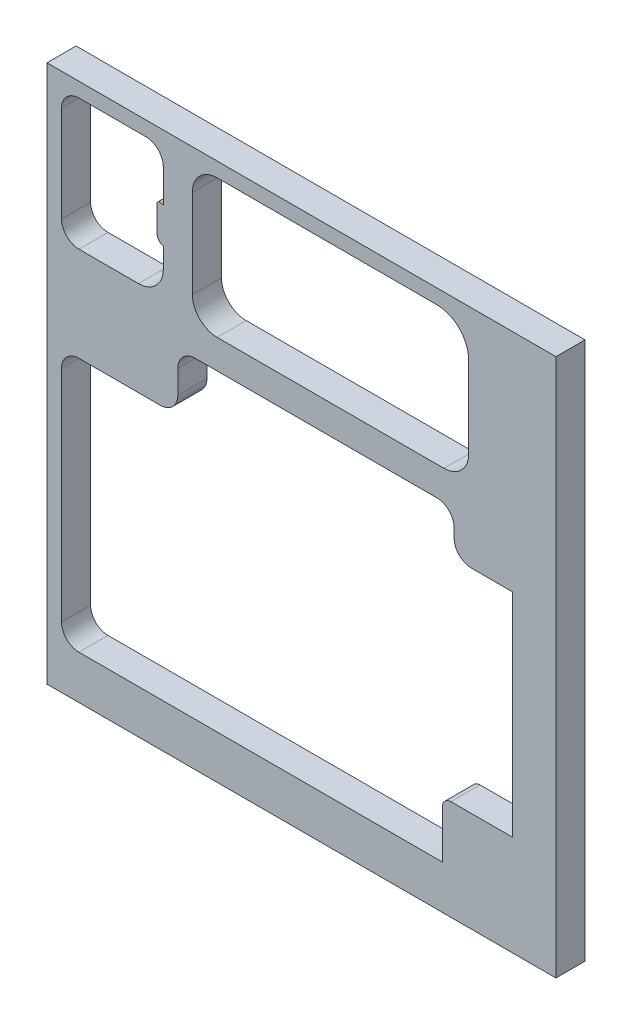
ISO-10303-21;
HEADER;
FILE_DESCRIPTION(('STEP AP214'),'2;1');
FILE_NAME('part.step','',(''),(''),'','','');
FILE_SCHEMA(('AUTOMOTIVE_DESIGN { 1 0 10303 214 1 1 1 1 }'));
ENDSEC;
DATA;
#1=APPLICATION_CONTEXT('core data for automotive mechanical design processes');
#2=APPLICATION_PROTOCOL_DEFINITION('international standard','automotive_design',2000,#1);
#3=PRODUCT_CONTEXT('',#1,'mechanical');
#4=PRODUCT('Part','Part','',(#3));
#5=PRODUCT_RELATED_PRODUCT_CATEGORY('part','',(#4));
#6=PRODUCT_DEFINITION_FORMATION('','',#4);
#7=PRODUCT_DEFINITION_CONTEXT('part definition',#1,'design');
#8=PRODUCT_DEFINITION('design','',#6,#7);
#9=PRODUCT_DEFINITION_SHAPE('','',#8);
#10=(LENGTH_UNIT() NAMED_UNIT(*) SI_UNIT(.MILLI.,.METRE.));
#11=(NAMED_UNIT(*) PLANE_ANGLE_UNIT() SI_UNIT($,.RADIAN.));
#12=(NAMED_UNIT(*) SI_UNIT($,.STERADIAN.) SOLID_ANGLE_UNIT());
#13=UNCERTAINTY_MEASURE_WITH_UNIT(LENGTH_MEASURE(1.E-05),#10,'distance_accuracy_value','');
#14=(GEOMETRIC_REPRESENTATION_CONTEXT(3) GLOBAL_UNCERTAINTY_ASSIGNED_CONTEXT((#13)) GLOBAL_UNIT_ASSIGNED_CONTEXT((#10,
#11,#12)) REPRESENTATION_CONTEXT('',''));
#15=CARTESIAN_POINT('',(0.,0.,0.));
#16=DIRECTION('',(0.,0.,1.));
#17=DIRECTION('',(1.,0.,0.));
#18=AXIS2_PLACEMENT_3D('',#15,#16,#17);
#19=CARTESIAN_POINT('',(19.05,215.9,-336.11392208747));
#20=DIRECTION('',(0.,1.,0.));
#21=DIRECTION('',(-1.,0.,0.));
#22=AXIS2_PLACEMENT_3D('',#19,#20,#21);
#23=PLANE('',#22);
#24=DIRECTION('',(1.,0.,0.));
#25=VECTOR('',#24,1.);
#26=CARTESIAN_POINT('',(19.05,215.9,-12.7));
#27=LINE('',#26,#25);
#28=CARTESIAN_POINT('',(-203.2,215.9,-12.7));
#29=VERTEX_POINT('',#28);
#30=CARTESIAN_POINT('',(19.05,215.9,-12.7));
#31=VERTEX_POINT('',#30);
#32=EDGE_CURVE('E11',#29,#31,#27,.T.);
#33=ORIENTED_EDGE('',*,*,#32,.F.);
#34=DIRECTION('',(0.,0.,1.));
#35=VECTOR('',#34,1.);
#36=CARTESIAN_POINT('',(-203.2,215.9,-336.11392208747));
#37=LINE('',#36,#35);
#38=CARTESIAN_POINT('',(-203.2,215.9,0.));
#39=VERTEX_POINT('',#38);
#40=EDGE_CURVE('E362',#29,#39,#37,.T.);
#41=ORIENTED_EDGE('',*,*,#40,.T.);
#42=DIRECTION('',(-1.,0.,0.));
#43=VECTOR('',#42,1.);
#44=CARTESIAN_POINT('',(19.05,215.9,0.));
#45=LINE('',#44,#43);
#46=CARTESIAN_POINT('',(19.05,215.9,0.));
#47=VERTEX_POINT('',#46);
#48=EDGE_CURVE('E347',#47,#39,#45,.T.);
#49=ORIENTED_EDGE('',*,*,#48,.F.);
#50=DIRECTION('',(0.,0.,1.));
#51=VECTOR('',#50,1.);
#52=CARTESIAN_POINT('',(19.05,215.9,-336.11392208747));
#53=LINE('',#52,#51);
#54=EDGE_CURVE('E356',#31,#47,#53,.T.);
#55=ORIENTED_EDGE('',*,*,#54,.F.);
#56=EDGE_LOOP('',(#33,#41,#49,#55));
#57=FACE_BOUND('',#56,.T.);
#58=ADVANCED_FACE('F41',(#57),#23,.T.);
#59=CARTESIAN_POINT('',(-203.2,-19.05,-336.11392208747));
#60=DIRECTION('',(-1.,0.,0.));
#61=DIRECTION('',(0.,0.,1.));
#62=AXIS2_PLACEMENT_3D('',#59,#60,#61);
#63=PLANE('',#62);
#64=DIRECTION('',(0.,1.,0.));
#65=VECTOR('',#64,1.);
#66=CARTESIAN_POINT('',(-203.2,-19.05,-12.7));
#67=LINE('',#66,#65);
#68=CARTESIAN_POINT('',(-203.2,-19.05,-12.7));
#69=VERTEX_POINT('',#68);
#70=EDGE_CURVE('E459',#69,#29,#67,.T.);
#71=ORIENTED_EDGE('',*,*,#70,.F.);
#72=DIRECTION('',(0.,0.,1.));
#73=VECTOR('',#72,1.);
#74=CARTESIAN_POINT('',(-203.2,-19.05,-336.11392208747));
#75=LINE('',#74,#73);
#76=CARTESIAN_POINT('',(-203.2,-19.05,0.));
#77=VERTEX_POINT('',#76);
#78=EDGE_CURVE('E359',#69,#77,#75,.T.);
#79=ORIENTED_EDGE('',*,*,#78,.T.);
#80=DIRECTION('',(0.,-1.,0.));
#81=VECTOR('',#80,1.);
#82=CARTESIAN_POINT('',(-203.2,-19.05,0.));
#83=LINE('',#82,#81);
#84=EDGE_CURVE('E350',#39,#77,#83,.T.);
#85=ORIENTED_EDGE('',*,*,#84,.F.);
#86=ORIENTED_EDGE('',*,*,#40,.F.);
#87=EDGE_LOOP('',(#71,#79,#85,#86));
#88=FACE_BOUND('',#87,.T.);
#89=ADVANCED_FACE('F658',(#88),#63,.T.);
#90=CARTESIAN_POINT('',(19.05,-19.05,-336.11392208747));
#91=DIRECTION('',(0.,-1.,0.));
#92=DIRECTION('',(1.,0.,0.));
#93=AXIS2_PLACEMENT_3D('',#90,#91,#92);
#94=PLANE('',#93);
#95=DIRECTION('',(-1.,0.,0.));
#96=VECTOR('',#95,1.);
#97=CARTESIAN_POINT('',(19.05,-19.05,-12.7));
#98=LINE('',#97,#96);
#99=CARTESIAN_POINT('',(19.05,-19.05,-12.7));
#100=VERTEX_POINT('',#99);
#101=EDGE_CURVE('E461',#100,#69,#98,.T.);
#102=ORIENTED_EDGE('',*,*,#101,.F.);
#103=DIRECTION('',(0.,0.,1.));
#104=VECTOR('',#103,1.);
#105=CARTESIAN_POINT('',(19.05,-19.05,-336.11392208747));
#106=LINE('',#105,#104);
#107=CARTESIAN_POINT('',(19.05,-19.05,0.));
#108=VERTEX_POINT('',#107);
#109=EDGE_CURVE('E167',#100,#108,#106,.T.);
#110=ORIENTED_EDGE('',*,*,#109,.T.);
#111=DIRECTION('',(1.,0.,0.));
#112=VECTOR('',#111,1.);
#113=CARTESIAN_POINT('',(19.05,-19.05,0.));
#114=LINE('',#113,#112);
#115=EDGE_CURVE('E353',#77,#108,#114,.T.);
#116=ORIENTED_EDGE('',*,*,#115,.F.);
#117=ORIENTED_EDGE('',*,*,#78,.F.);
#118=EDGE_LOOP('',(#102,#110,#116,#117));
#119=FACE_BOUND('',#118,.T.);
#120=ADVANCED_FACE('F392',(#119),#94,.T.);
#121=CARTESIAN_POINT('',(19.05,-19.05,-336.11392208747));
#122=DIRECTION('',(1.,0.,0.));
#123=DIRECTION('',(0.,0.,-1.));
#124=AXIS2_PLACEMENT_3D('',#121,#122,#123);
#125=PLANE('',#124);
#126=DIRECTION('',(0.,-1.,0.));
#127=VECTOR('',#126,1.);
#128=CARTESIAN_POINT('',(19.05,-19.05,-12.7));
#129=LINE('',#128,#127);
#130=EDGE_CURVE('E375',#31,#100,#129,.T.);
#131=ORIENTED_EDGE('',*,*,#130,.F.);
#132=ORIENTED_EDGE('',*,*,#54,.T.);
#133=DIRECTION('',(0.,1.,0.));
#134=VECTOR('',#133,1.);
#135=CARTESIAN_POINT('',(19.05,-19.05,0.));
#136=LINE('',#135,#134);
#137=EDGE_CURVE('E324',#108,#47,#136,.T.);
#138=ORIENTED_EDGE('',*,*,#137,.F.);
#139=ORIENTED_EDGE('',*,*,#109,.F.);
#140=EDGE_LOOP('',(#131,#132,#138,#139));
#141=FACE_BOUND('',#140,.T.);
#142=ADVANCED_FACE('F43',(#141),#125,.T.);
#143=CARTESIAN_POINT('',(-128.905,149.225,-336.11392208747));
#144=DIRECTION('',(0.,-1.,0.));
#145=DIRECTION('',(1.,0.,0.));
#146=AXIS2_PLACEMENT_3D('',#143,#144,#145);
#147=PLANE('',#146);
#148=DIRECTION('',(0.,0.,1.));
#149=VECTOR('',#148,1.);
#150=CARTESIAN_POINT('',(-29.8450000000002,149.225,-336.11392208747));
#151=LINE('',#150,#149);
#152=CARTESIAN_POINT('',(-29.8450000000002,149.225,-12.7));
#153=VERTEX_POINT('',#152);
#154=CARTESIAN_POINT('',(-29.8450000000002,149.225,0.));
#155=VERTEX_POINT('',#154);
#156=EDGE_CURVE('E340',#153,#155,#151,.T.);
#157=ORIENTED_EDGE('',*,*,#156,.F.);
#158=DIRECTION('',(-1.,0.,0.));
#159=VECTOR('',#158,1.);
#160=CARTESIAN_POINT('',(-128.905,149.225,-12.7));
#161=LINE('',#160,#159);
#162=CARTESIAN_POINT('',(-128.905,149.225,-12.7));
#163=VERTEX_POINT('',#162);
#164=EDGE_CURVE('E60',#153,#163,#161,.T.);
#165=ORIENTED_EDGE('',*,*,#164,.T.);
#166=DIRECTION('',(0.,0.,1.));
#167=VECTOR('',#166,1.);
#168=CARTESIAN_POINT('',(-128.905,149.225,-336.11392208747));
#169=LINE('',#168,#167);
#170=CARTESIAN_POINT('',(-128.905,149.225,0.));
#171=VERTEX_POINT('',#170);
#172=EDGE_CURVE('E320',#163,#171,#169,.T.);
#173=ORIENTED_EDGE('',*,*,#172,.T.);
#174=DIRECTION('',(1.,0.,0.));
#175=VECTOR('',#174,1.);
#176=CARTESIAN_POINT('',(-128.905,149.225,0.));
#177=LINE('',#176,#175);
#178=EDGE_CURVE('E299',#171,#155,#177,.T.);
#179=ORIENTED_EDGE('',*,*,#178,.T.);
#180=EDGE_LOOP('',(#157,#165,#173,#179));
#181=FACE_BOUND('',#180,.T.);
#182=ADVANCED_FACE('F635',(#181),#147,.F.);
#183=CARTESIAN_POINT('',(-29.8450000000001,160.02,-336.11392208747));
#184=DIRECTION('',(0.,0.,1.));
#185=DIRECTION('',(1.,0.,0.));
#186=AXIS2_PLACEMENT_3D('',#183,#184,#185);
#187=CYLINDRICAL_SURFACE('',#186,10.795);
#188=DIRECTION('',(0.,0.,1.));
#189=VECTOR('',#188,1.);
#190=CARTESIAN_POINT('',(-19.0500000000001,160.02,-336.11392208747));
#191=LINE('',#190,#189);
#192=CARTESIAN_POINT('',(-19.0500000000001,160.02,-12.7));
#193=VERTEX_POINT('',#192);
#194=CARTESIAN_POINT('',(-19.0500000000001,160.02,0.));
#195=VERTEX_POINT('',#194);
#196=EDGE_CURVE('E337',#193,#195,#191,.T.);
#197=ORIENTED_EDGE('',*,*,#196,.F.);
#198=CARTESIAN_POINT('',(-29.8450000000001,160.02,-12.7));
#199=DIRECTION('',(0.,0.,1.));
#200=DIRECTION('',(1.,0.,0.));
#201=AXIS2_PLACEMENT_3D('',#198,#199,#200);
#202=CIRCLE('',#201,10.795);
#203=EDGE_CURVE('E51',#193,#153,#202,.F.);
#204=ORIENTED_EDGE('',*,*,#203,.T.);
#205=ORIENTED_EDGE('',*,*,#156,.T.);
#206=CARTESIAN_POINT('',(-29.8450000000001,160.02,0.));
#207=DIRECTION('',(0.,0.,1.));
#208=DIRECTION('',(1.,0.,0.));
#209=AXIS2_PLACEMENT_3D('',#206,#207,#208);
#210=CIRCLE('',#209,10.795);
#211=EDGE_CURVE('E302',#155,#195,#210,.T.);
#212=ORIENTED_EDGE('',*,*,#211,.T.);
#213=EDGE_LOOP('',(#197,#204,#205,#212));
#214=FACE_BOUND('',#213,.T.);
#215=ADVANCED_FACE('F642',(#214),#187,.F.);
#216=CARTESIAN_POINT('',(-19.0500000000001,160.02,-336.11392208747));
#217=DIRECTION('',(1.,0.,0.));
#218=DIRECTION('',(0.,1.,0.));
#219=AXIS2_PLACEMENT_3D('',#216,#217,#218);
#220=PLANE('',#219);
#221=DIRECTION('',(0.,0.,1.));
#222=VECTOR('',#221,1.);
#223=CARTESIAN_POINT('',(-19.0500000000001,195.58,-336.11392208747));
#224=LINE('',#223,#222);
#225=CARTESIAN_POINT('',(-19.0500000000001,195.58,-12.7));
#226=VERTEX_POINT('',#225);
#227=CARTESIAN_POINT('',(-19.0500000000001,195.58,0.));
#228=VERTEX_POINT('',#227);
#229=EDGE_CURVE('E334',#226,#228,#224,.T.);
#230=ORIENTED_EDGE('',*,*,#229,.F.);
#231=DIRECTION('',(0.,-1.,0.));
#232=VECTOR('',#231,1.);
#233=CARTESIAN_POINT('',(-19.0500000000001,160.02,-12.7));
#234=LINE('',#233,#232);
#235=EDGE_CURVE('E429',#226,#193,#234,.T.);
#236=ORIENTED_EDGE('',*,*,#235,.T.);
#237=ORIENTED_EDGE('',*,*,#196,.T.);
#238=DIRECTION('',(0.,1.,0.));
#239=VECTOR('',#238,1.);
#240=CARTESIAN_POINT('',(-19.0500000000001,160.02,0.));
#241=LINE('',#240,#239);
#242=EDGE_CURVE('E305',#195,#228,#241,.T.);
#243=ORIENTED_EDGE('',*,*,#242,.T.);
#244=EDGE_LOOP('',(#230,#236,#237,#243));
#245=FACE_BOUND('',#244,.T.);
#246=ADVANCED_FACE('F437',(#245),#220,.F.);
#247=CARTESIAN_POINT('',(-33.0200000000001,195.58,-336.11392208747));
#248=DIRECTION('',(0.,0.,1.));
#249=DIRECTION('',(1.,0.,0.));
#250=AXIS2_PLACEMENT_3D('',#247,#248,#249);
#251=CYLINDRICAL_SURFACE('',#250,13.97);
#252=DIRECTION('',(0.,0.,1.));
#253=VECTOR('',#252,1.);
#254=CARTESIAN_POINT('',(-33.0200000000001,209.55,-336.11392208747));
#255=LINE('',#254,#253);
#256=CARTESIAN_POINT('',(-33.0200000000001,209.55,-12.7));
#257=VERTEX_POINT('',#256);
#258=CARTESIAN_POINT('',(-33.0200000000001,209.55,0.));
#259=VERTEX_POINT('',#258);
#260=EDGE_CURVE('E331',#257,#259,#255,.T.);
#261=ORIENTED_EDGE('',*,*,#260,.F.);
#262=CARTESIAN_POINT('',(-33.0200000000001,195.58,-12.7));
#263=DIRECTION('',(0.,0.,1.));
#264=DIRECTION('',(1.,0.,0.));
#265=AXIS2_PLACEMENT_3D('',#262,#263,#264);
#266=CIRCLE('',#265,13.97);
#267=EDGE_CURVE('E432',#257,#226,#266,.F.);
#268=ORIENTED_EDGE('',*,*,#267,.T.);
#269=ORIENTED_EDGE('',*,*,#229,.T.);
#270=CARTESIAN_POINT('',(-33.0200000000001,195.58,0.));
#271=DIRECTION('',(0.,0.,1.));
#272=DIRECTION('',(1.,0.,0.));
#273=AXIS2_PLACEMENT_3D('',#270,#271,#272);
#274=CIRCLE('',#273,13.97);
#275=EDGE_CURVE('E308',#228,#259,#274,.T.);
#276=ORIENTED_EDGE('',*,*,#275,.T.);
#277=EDGE_LOOP('',(#261,#268,#269,#276));
#278=FACE_BOUND('',#277,.T.);
#279=ADVANCED_FACE('F442',(#278),#251,.F.);
#280=CARTESIAN_POINT('',(-33.0200000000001,209.55,-336.11392208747));
#281=DIRECTION('',(0.,1.,0.));
#282=DIRECTION('',(-1.,0.,0.));
#283=AXIS2_PLACEMENT_3D('',#280,#281,#282);
#284=PLANE('',#283);
#285=DIRECTION('',(0.,0.,1.));
#286=VECTOR('',#285,1.);
#287=CARTESIAN_POINT('',(-128.905,209.55,-336.11392208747));
#288=LINE('',#287,#286);
#289=CARTESIAN_POINT('',(-128.905,209.55,-12.7));
#290=VERTEX_POINT('',#289);
#291=CARTESIAN_POINT('',(-128.905,209.55,0.));
#292=VERTEX_POINT('',#291);
#293=EDGE_CURVE('E328',#290,#292,#288,.T.);
#294=ORIENTED_EDGE('',*,*,#293,.F.);
#295=DIRECTION('',(1.,0.,0.));
#296=VECTOR('',#295,1.);
#297=CARTESIAN_POINT('',(-33.0200000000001,209.55,-12.7));
#298=LINE('',#297,#296);
#299=EDGE_CURVE('E444',#290,#257,#298,.T.);
#300=ORIENTED_EDGE('',*,*,#299,.T.);
#301=ORIENTED_EDGE('',*,*,#260,.T.);
#302=DIRECTION('',(-1.,0.,0.));
#303=VECTOR('',#302,1.);
#304=CARTESIAN_POINT('',(-33.0200000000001,209.55,0.));
#305=LINE('',#304,#303);
#306=EDGE_CURVE('E311',#259,#292,#305,.T.);
#307=ORIENTED_EDGE('',*,*,#306,.T.);
#308=EDGE_LOOP('',(#294,#300,#301,#307));
#309=FACE_BOUND('',#308,.T.);
#310=ADVANCED_FACE('F646',(#309),#284,.F.);
#311=CARTESIAN_POINT('',(-128.905,198.755,-336.11392208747));
#312=DIRECTION('',(0.,0.,1.));
#313=DIRECTION('',(1.,0.,0.));
#314=AXIS2_PLACEMENT_3D('',#311,#312,#313);
#315=CYLINDRICAL_SURFACE('',#314,10.795);
#316=DIRECTION('',(0.,0.,1.));
#317=VECTOR('',#316,1.);
#318=CARTESIAN_POINT('',(-139.7,198.755,-336.11392208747));
#319=LINE('',#318,#317);
#320=CARTESIAN_POINT('',(-139.7,198.755,-12.7));
#321=VERTEX_POINT('',#320);
#322=CARTESIAN_POINT('',(-139.7,198.755,0.));
#323=VERTEX_POINT('',#322);
#324=EDGE_CURVE('E325',#321,#323,#319,.T.);
#325=ORIENTED_EDGE('',*,*,#324,.F.);
#326=CARTESIAN_POINT('',(-128.905,198.755,-12.7));
#327=DIRECTION('',(0.,0.,1.));
#328=DIRECTION('',(1.,0.,0.));
#329=AXIS2_PLACEMENT_3D('',#326,#327,#328);
#330=CIRCLE('',#329,10.795);
#331=EDGE_CURVE('E446',#321,#290,#330,.F.);
#332=ORIENTED_EDGE('',*,*,#331,.T.);
#333=ORIENTED_EDGE('',*,*,#293,.T.);
#334=CARTESIAN_POINT('',(-128.905,198.755,0.));
#335=DIRECTION('',(0.,0.,1.));
#336=DIRECTION('',(1.,0.,0.));
#337=AXIS2_PLACEMENT_3D('',#334,#335,#336);
#338=CIRCLE('',#337,10.795);
#339=EDGE_CURVE('E314',#292,#323,#338,.T.);
#340=ORIENTED_EDGE('',*,*,#339,.T.);
#341=EDGE_LOOP('',(#325,#332,#333,#340));
#342=FACE_BOUND('',#341,.T.);
#343=ADVANCED_FACE('F648',(#342),#315,.F.);
#344=CARTESIAN_POINT('',(-139.7,198.755,-336.11392208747));
#345=DIRECTION('',(-1.,0.,0.));
#346=DIRECTION('',(0.,0.,1.));
#347=AXIS2_PLACEMENT_3D('',#344,#345,#346);
#348=PLANE('',#347);
#349=DIRECTION('',(0.,0.,1.));
#350=VECTOR('',#349,1.);
#351=CARTESIAN_POINT('',(-139.7,160.02,-336.11392208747));
#352=LINE('',#351,#350);
#353=CARTESIAN_POINT('',(-139.7,160.02,-12.7));
#354=VERTEX_POINT('',#353);
#355=CARTESIAN_POINT('',(-139.7,160.02,0.));
#356=VERTEX_POINT('',#355);
#357=EDGE_CURVE('E321',#354,#356,#352,.T.);
#358=ORIENTED_EDGE('',*,*,#357,.F.);
#359=DIRECTION('',(0.,1.,0.));
#360=VECTOR('',#359,1.);
#361=CARTESIAN_POINT('',(-139.7,198.755,-12.7));
#362=LINE('',#361,#360);
#363=EDGE_CURVE('E452',#354,#321,#362,.T.);
#364=ORIENTED_EDGE('',*,*,#363,.T.);
#365=ORIENTED_EDGE('',*,*,#324,.T.);
#366=DIRECTION('',(0.,-1.,0.));
#367=VECTOR('',#366,1.);
#368=CARTESIAN_POINT('',(-139.7,198.755,0.));
#369=LINE('',#368,#367);
#370=EDGE_CURVE('E317',#323,#356,#369,.T.);
#371=ORIENTED_EDGE('',*,*,#370,.T.);
#372=EDGE_LOOP('',(#358,#364,#365,#371));
#373=FACE_BOUND('',#372,.T.);
#374=ADVANCED_FACE('F628',(#373),#348,.F.);
#375=CARTESIAN_POINT('',(-128.905,160.02,-336.11392208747));
#376=DIRECTION('',(0.,0.,1.));
#377=DIRECTION('',(1.,0.,0.));
#378=AXIS2_PLACEMENT_3D('',#375,#376,#377);
#379=CYLINDRICAL_SURFACE('',#378,10.795);
#380=ORIENTED_EDGE('',*,*,#172,.F.);
#381=CARTESIAN_POINT('',(-128.905,160.02,-12.7));
#382=DIRECTION('',(0.,0.,1.));
#383=DIRECTION('',(1.,0.,0.));
#384=AXIS2_PLACEMENT_3D('',#381,#382,#383);
#385=CIRCLE('',#384,10.795);
#386=EDGE_CURVE('E455',#163,#354,#385,.F.);
#387=ORIENTED_EDGE('',*,*,#386,.T.);
#388=ORIENTED_EDGE('',*,*,#357,.T.);
#389=CARTESIAN_POINT('',(-128.905,160.02,0.));
#390=DIRECTION('',(0.,0.,1.));
#391=DIRECTION('',(1.,0.,0.));
#392=AXIS2_PLACEMENT_3D('',#389,#390,#391);
#393=CIRCLE('',#392,10.795);
#394=EDGE_CURVE('E249',#356,#171,#393,.T.);
#395=ORIENTED_EDGE('',*,*,#394,.T.);
#396=EDGE_LOOP('',(#380,#387,#388,#395));
#397=FACE_BOUND('',#396,.T.);
#398=ADVANCED_FACE('F623',(#397),#379,.F.);
#399=CARTESIAN_POINT('',(-189.23,0.,-336.11392208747));
#400=DIRECTION('',(0.,-1.,0.));
#401=DIRECTION('',(1.,0.,0.));
#402=AXIS2_PLACEMENT_3D('',#399,#400,#401);
#403=PLANE('',#402);
#404=DIRECTION('',(0.,0.,1.));
#405=VECTOR('',#404,1.);
#406=CARTESIAN_POINT('',(-30.4800000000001,0.,-336.11392208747));
#407=LINE('',#406,#405);
#408=CARTESIAN_POINT('',(-30.4800000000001,0.,-12.7));
#409=VERTEX_POINT('',#408);
#410=CARTESIAN_POINT('',(-30.4800000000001,0.,0.));
#411=VERTEX_POINT('',#410);
#412=EDGE_CURVE('E292',#409,#411,#407,.T.);
#413=ORIENTED_EDGE('',*,*,#412,.F.);
#414=DIRECTION('',(-1.,0.,0.));
#415=VECTOR('',#414,1.);
#416=CARTESIAN_POINT('',(-189.23,0.,-12.7));
#417=LINE('',#416,#415);
#418=CARTESIAN_POINT('',(-189.23,0.,-12.7));
#419=VERTEX_POINT('',#418);
#420=EDGE_CURVE('E166',#409,#419,#417,.T.);
#421=ORIENTED_EDGE('',*,*,#420,.T.);
#422=DIRECTION('',(0.,0.,1.));
#423=VECTOR('',#422,1.);
#424=CARTESIAN_POINT('',(-189.23,0.,-336.11392208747));
#425=LINE('',#424,#423);
#426=CARTESIAN_POINT('',(-189.23,0.,0.));
#427=VERTEX_POINT('',#426);
#428=EDGE_CURVE('E245',#419,#427,#425,.T.);
#429=ORIENTED_EDGE('',*,*,#428,.T.);
#430=DIRECTION('',(1.,0.,0.));
#431=VECTOR('',#430,1.);
#432=CARTESIAN_POINT('',(-189.23,0.,0.));
#433=LINE('',#432,#431);
#434=EDGE_CURVE('E196',#427,#411,#433,.T.);
#435=ORIENTED_EDGE('',*,*,#434,.T.);
#436=EDGE_LOOP('',(#413,#421,#429,#435));
#437=FACE_BOUND('',#436,.T.);
#438=ADVANCED_FACE('F671',(#437),#403,.F.);
#439=CARTESIAN_POINT('',(-30.4800000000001,0.,-336.11392208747));
#440=DIRECTION('',(1.,0.,0.));
#441=DIRECTION('',(0.,0.,-1.));
#442=AXIS2_PLACEMENT_3D('',#439,#440,#441);
#443=PLANE('',#442);
#444=DIRECTION('',(0.,0.,1.));
#445=VECTOR('',#444,1.);
#446=CARTESIAN_POINT('',(-30.4800000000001,21.0185211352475,-336.11392208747));
#447=LINE('',#446,#445);
#448=CARTESIAN_POINT('',(-30.4800000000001,21.0185211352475,-12.7));
#449=VERTEX_POINT('',#448);
#450=CARTESIAN_POINT('',(-30.4800000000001,21.0185211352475,0.));
#451=VERTEX_POINT('',#450);
#452=EDGE_CURVE('E289',#449,#451,#447,.T.);
#453=ORIENTED_EDGE('',*,*,#452,.F.);
#454=DIRECTION('',(0.,-1.,0.));
#455=VECTOR('',#454,1.);
#456=CARTESIAN_POINT('',(-30.4800000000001,0.,-12.7));
#457=LINE('',#456,#455);
#458=EDGE_CURVE('E457',#449,#409,#457,.T.);
#459=ORIENTED_EDGE('',*,*,#458,.T.);
#460=ORIENTED_EDGE('',*,*,#412,.T.);
#461=DIRECTION('',(0.,1.,0.));
#462=VECTOR('',#461,1.);
#463=CARTESIAN_POINT('',(-30.4800000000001,0.,0.));
#464=LINE('',#463,#462);
#465=EDGE_CURVE('E200',#411,#451,#464,.T.);
#466=ORIENTED_EDGE('',*,*,#465,.T.);
#467=EDGE_LOOP('',(#453,#459,#460,#466));
#468=FACE_BOUND('',#467,.T.);
#469=ADVANCED_FACE('F714',(#468),#443,.F.);
#470=CARTESIAN_POINT('',(-26.7970000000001,21.0185211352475,-336.11392208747));
#471=DIRECTION('',(0.,0.,1.));
#472=DIRECTION('',(1.,0.,0.));
#473=AXIS2_PLACEMENT_3D('',#470,#471,#472);
#474=CYLINDRICAL_SURFACE('',#473,3.683);
#475=DIRECTION('',(0.,0.,1.));
#476=VECTOR('',#475,1.);
#477=CARTESIAN_POINT('',(-26.797,24.7015211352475,-336.11392208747));
#478=LINE('',#477,#476);
#479=CARTESIAN_POINT('',(-26.797,24.7015211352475,-12.7));
#480=VERTEX_POINT('',#479);
#481=CARTESIAN_POINT('',(-26.797,24.7015211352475,0.));
#482=VERTEX_POINT('',#481);
#483=EDGE_CURVE('E286',#480,#482,#478,.T.);
#484=ORIENTED_EDGE('',*,*,#483,.F.);
#485=CARTESIAN_POINT('',(-26.7970000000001,21.0185211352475,-12.7));
#486=DIRECTION('',(0.,0.,1.));
#487=DIRECTION('',(1.,0.,0.));
#488=AXIS2_PLACEMENT_3D('',#485,#486,#487);
#489=CIRCLE('',#488,3.683);
#490=EDGE_CURVE('E1066',#480,#449,#489,.T.);
#491=ORIENTED_EDGE('',*,*,#490,.T.);
#492=ORIENTED_EDGE('',*,*,#452,.T.);
#493=CARTESIAN_POINT('',(-26.7970000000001,21.0185211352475,0.));
#494=DIRECTION('',(0.,0.,-1.));
#495=DIRECTION('',(1.,0.,0.));
#496=AXIS2_PLACEMENT_3D('',#493,#494,#495);
#497=CIRCLE('',#496,3.683);
#498=EDGE_CURVE('E203',#451,#482,#497,.T.);
#499=ORIENTED_EDGE('',*,*,#498,.T.);
#500=EDGE_LOOP('',(#484,#491,#492,#499));
#501=FACE_BOUND('',#500,.T.);
#502=ADVANCED_FACE('F724',(#501),#474,.T.);
#503=CARTESIAN_POINT('',(-26.797,24.7015211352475,-336.11392208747));
#504=DIRECTION('',(0.,-1.,0.));
#505=DIRECTION('',(1.,0.,0.));
#506=AXIS2_PLACEMENT_3D('',#503,#504,#505);
#507=PLANE('',#506);
#508=DIRECTION('',(0.,0.,1.));
#509=VECTOR('',#508,1.);
#510=CARTESIAN_POINT('',(0.,24.7015211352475,-336.11392208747));
#511=LINE('',#510,#509);
#512=CARTESIAN_POINT('',(0.,24.7015211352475,-12.7));
#513=VERTEX_POINT('',#512);
#514=CARTESIAN_POINT('',(0.,24.7015211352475,0.));
#515=VERTEX_POINT('',#514);
#516=EDGE_CURVE('E283',#513,#515,#511,.T.);
#517=ORIENTED_EDGE('',*,*,#516,.F.);
#518=DIRECTION('',(-1.,0.,0.));
#519=VECTOR('',#518,1.);
#520=CARTESIAN_POINT('',(-26.797,24.7015211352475,-12.7));
#521=LINE('',#520,#519);
#522=EDGE_CURVE('E1069',#513,#480,#521,.T.);
#523=ORIENTED_EDGE('',*,*,#522,.T.);
#524=ORIENTED_EDGE('',*,*,#483,.T.);
#525=DIRECTION('',(1.,0.,0.));
#526=VECTOR('',#525,1.);
#527=CARTESIAN_POINT('',(-26.797,24.7015211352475,0.));
#528=LINE('',#527,#526);
#529=EDGE_CURVE('E206',#482,#515,#528,.T.);
#530=ORIENTED_EDGE('',*,*,#529,.T.);
#531=EDGE_LOOP('',(#517,#523,#524,#530));
#532=FACE_BOUND('',#531,.T.);
#533=ADVANCED_FACE('F734',(#532),#507,.F.);
#534=CARTESIAN_POINT('',(0.,24.7015211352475,-336.11392208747));
#535=DIRECTION('',(1.,0.,0.));
#536=DIRECTION('',(0.,0.,-1.));
#537=AXIS2_PLACEMENT_3D('',#534,#535,#536);
#538=PLANE('',#537);
#539=DIRECTION('',(0.,0.,1.));
#540=VECTOR('',#539,1.);
#541=CARTESIAN_POINT('',(0.,117.475,-336.11392208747));
#542=LINE('',#541,#540);
#543=CARTESIAN_POINT('',(0.,117.475,-12.7));
#544=VERTEX_POINT('',#543);
#545=CARTESIAN_POINT('',(0.,117.475,0.));
#546=VERTEX_POINT('',#545);
#547=EDGE_CURVE('E280',#544,#546,#542,.T.);
#548=ORIENTED_EDGE('',*,*,#547,.F.);
#549=DIRECTION('',(0.,-1.,0.));
#550=VECTOR('',#549,1.);
#551=CARTESIAN_POINT('',(0.,24.7015211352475,-12.7));
#552=LINE('',#551,#550);
#553=EDGE_CURVE('E1072',#544,#513,#552,.T.);
#554=ORIENTED_EDGE('',*,*,#553,.T.);
#555=ORIENTED_EDGE('',*,*,#516,.T.);
#556=DIRECTION('',(0.,1.,0.));
#557=VECTOR('',#556,1.);
#558=CARTESIAN_POINT('',(0.,24.7015211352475,0.));
#559=LINE('',#558,#557);
#560=EDGE_CURVE('E209',#515,#546,#559,.T.);
#561=ORIENTED_EDGE('',*,*,#560,.T.);
#562=EDGE_LOOP('',(#548,#554,#555,#561));
#563=FACE_BOUND('',#562,.T.);
#564=ADVANCED_FACE('F744',(#563),#538,.F.);
#565=CARTESIAN_POINT('',(0.,117.475,-336.11392208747));
#566=DIRECTION('',(0.,1.,0.));
#567=DIRECTION('',(0.,0.,1.));
#568=AXIS2_PLACEMENT_3D('',#565,#566,#567);
#569=PLANE('',#568);
#570=DIRECTION('',(0.,0.,1.));
#571=VECTOR('',#570,1.);
#572=CARTESIAN_POINT('',(-17.7799999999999,117.475,-336.11392208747));
#573=LINE('',#572,#571);
#574=CARTESIAN_POINT('',(-17.7799999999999,117.475,-12.7));
#575=VERTEX_POINT('',#574);
#576=CARTESIAN_POINT('',(-17.7799999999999,117.475,0.));
#577=VERTEX_POINT('',#576);
#578=EDGE_CURVE('E277',#575,#577,#573,.T.);
#579=ORIENTED_EDGE('',*,*,#578,.F.);
#580=DIRECTION('',(1.,0.,0.));
#581=VECTOR('',#580,1.);
#582=CARTESIAN_POINT('',(0.,117.475,-12.7));
#583=LINE('',#582,#581);
#584=EDGE_CURVE('E1075',#575,#544,#583,.T.);
#585=ORIENTED_EDGE('',*,*,#584,.T.);
#586=ORIENTED_EDGE('',*,*,#547,.T.);
#587=DIRECTION('',(-1.,0.,0.));
#588=VECTOR('',#587,1.);
#589=CARTESIAN_POINT('',(0.,117.475,0.));
#590=LINE('',#589,#588);
#591=EDGE_CURVE('E212',#546,#577,#590,.T.);
#592=ORIENTED_EDGE('',*,*,#591,.T.);
#593=EDGE_LOOP('',(#579,#585,#586,#592));
#594=FACE_BOUND('',#593,.T.);
#595=ADVANCED_FACE('F754',(#594),#569,.F.);
#596=CARTESIAN_POINT('',(-17.78,125.095,-336.11392208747));
#597=DIRECTION('',(0.,0.,1.));
#598=DIRECTION('',(1.,0.,0.));
#599=AXIS2_PLACEMENT_3D('',#596,#597,#598);
#600=CYLINDRICAL_SURFACE('',#599,7.61999999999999);
#601=DIRECTION('',(0.,0.,1.));
#602=VECTOR('',#601,1.);
#603=CARTESIAN_POINT('',(-25.4,125.095,-336.11392208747));
#604=LINE('',#603,#602);
#605=CARTESIAN_POINT('',(-25.4,125.095,-12.7));
#606=VERTEX_POINT('',#605);
#607=CARTESIAN_POINT('',(-25.4,125.095,0.));
#608=VERTEX_POINT('',#607);
#609=EDGE_CURVE('E274',#606,#608,#604,.T.);
#610=ORIENTED_EDGE('',*,*,#609,.F.);
#611=CARTESIAN_POINT('',(-17.78,125.095,-12.7));
#612=DIRECTION('',(0.,0.,1.));
#613=DIRECTION('',(1.,0.,0.));
#614=AXIS2_PLACEMENT_3D('',#611,#612,#613);
#615=CIRCLE('',#614,7.61999999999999);
#616=EDGE_CURVE('E1078',#606,#575,#615,.T.);
#617=ORIENTED_EDGE('',*,*,#616,.T.);
#618=ORIENTED_EDGE('',*,*,#578,.T.);
#619=CARTESIAN_POINT('',(-17.78,125.095,0.));
#620=DIRECTION('',(0.,0.,-1.));
#621=DIRECTION('',(1.,0.,0.));
#622=AXIS2_PLACEMENT_3D('',#619,#620,#621);
#623=CIRCLE('',#622,7.61999999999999);
#624=EDGE_CURVE('E215',#577,#608,#623,.T.);
#625=ORIENTED_EDGE('',*,*,#624,.T.);
#626=EDGE_LOOP('',(#610,#617,#618,#625));
#627=FACE_BOUND('',#626,.T.);
#628=ADVANCED_FACE('F764',(#627),#600,.T.);
#629=CARTESIAN_POINT('',(-25.4,125.095,-336.11392208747));
#630=DIRECTION('',(1.,0.,0.));
#631=DIRECTION('',(0.,1.,0.));
#632=AXIS2_PLACEMENT_3D('',#629,#630,#631);
#633=PLANE('',#632);
#634=DIRECTION('',(0.,0.,1.));
#635=VECTOR('',#634,1.);
#636=CARTESIAN_POINT('',(-25.4,128.905,-336.11392208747));
#637=LINE('',#636,#635);
#638=CARTESIAN_POINT('',(-25.4,128.905,-12.7));
#639=VERTEX_POINT('',#638);
#640=CARTESIAN_POINT('',(-25.4,128.905,0.));
#641=VERTEX_POINT('',#640);
#642=EDGE_CURVE('E271',#639,#641,#637,.T.);
#643=ORIENTED_EDGE('',*,*,#642,.F.);
#644=DIRECTION('',(0.,-1.,0.));
#645=VECTOR('',#644,1.);
#646=CARTESIAN_POINT('',(-25.4,125.095,-12.7));
#647=LINE('',#646,#645);
#648=EDGE_CURVE('E1081',#639,#606,#647,.T.);
#649=ORIENTED_EDGE('',*,*,#648,.T.);
#650=ORIENTED_EDGE('',*,*,#609,.T.);
#651=DIRECTION('',(0.,1.,0.));
#652=VECTOR('',#651,1.);
#653=CARTESIAN_POINT('',(-25.4,125.095,0.));
#654=LINE('',#653,#652);
#655=EDGE_CURVE('E218',#608,#641,#654,.T.);
#656=ORIENTED_EDGE('',*,*,#655,.T.);
#657=EDGE_LOOP('',(#643,#649,#650,#656));
#658=FACE_BOUND('',#657,.T.);
#659=ADVANCED_FACE('F774',(#658),#633,.F.);
#660=CARTESIAN_POINT('',(-33.0199999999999,128.905,-336.11392208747));
#661=DIRECTION('',(0.,0.,1.));
#662=DIRECTION('',(1.,0.,0.));
#663=AXIS2_PLACEMENT_3D('',#660,#661,#662);
#664=CYLINDRICAL_SURFACE('',#663,7.61999999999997);
#665=DIRECTION('',(0.,0.,1.));
#666=VECTOR('',#665,1.);
#667=CARTESIAN_POINT('',(-33.0200000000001,136.525,-336.11392208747));
#668=LINE('',#667,#666);
#669=CARTESIAN_POINT('',(-33.0200000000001,136.525,-12.7));
#670=VERTEX_POINT('',#669);
#671=CARTESIAN_POINT('',(-33.0200000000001,136.525,0.));
#672=VERTEX_POINT('',#671);
#673=EDGE_CURVE('E268',#670,#672,#668,.T.);
#674=ORIENTED_EDGE('',*,*,#673,.F.);
#675=CARTESIAN_POINT('',(-33.0199999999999,128.905,-12.7));
#676=DIRECTION('',(0.,0.,1.));
#677=DIRECTION('',(1.,0.,0.));
#678=AXIS2_PLACEMENT_3D('',#675,#676,#677);
#679=CIRCLE('',#678,7.61999999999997);
#680=EDGE_CURVE('E1084',#670,#639,#679,.F.);
#681=ORIENTED_EDGE('',*,*,#680,.T.);
#682=ORIENTED_EDGE('',*,*,#642,.T.);
#683=CARTESIAN_POINT('',(-33.0199999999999,128.905,0.));
#684=DIRECTION('',(0.,0.,1.));
#685=DIRECTION('',(1.,0.,0.));
#686=AXIS2_PLACEMENT_3D('',#683,#684,#685);
#687=CIRCLE('',#686,7.61999999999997);
#688=EDGE_CURVE('E221',#641,#672,#687,.T.);
#689=ORIENTED_EDGE('',*,*,#688,.T.);
#690=EDGE_LOOP('',(#674,#681,#682,#689));
#691=FACE_BOUND('',#690,.T.);
#692=ADVANCED_FACE('F784',(#691),#664,.F.);
#693=CARTESIAN_POINT('',(-33.0200000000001,136.525,-336.11392208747));
#694=DIRECTION('',(0.,1.,0.));
#695=DIRECTION('',(0.,0.,1.));
#696=AXIS2_PLACEMENT_3D('',#693,#694,#695);
#697=PLANE('',#696);
#698=DIRECTION('',(0.,0.,1.));
#699=VECTOR('',#698,1.);
#700=CARTESIAN_POINT('',(-138.43,136.525,-336.11392208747));
#701=LINE('',#700,#699);
#702=CARTESIAN_POINT('',(-138.43,136.525,-12.7));
#703=VERTEX_POINT('',#702);
#704=CARTESIAN_POINT('',(-138.43,136.525,0.));
#705=VERTEX_POINT('',#704);
#706=EDGE_CURVE('E265',#703,#705,#701,.T.);
#707=ORIENTED_EDGE('',*,*,#706,.F.);
#708=DIRECTION('',(1.,0.,0.));
#709=VECTOR('',#708,1.);
#710=CARTESIAN_POINT('',(-33.0200000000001,136.525,-12.7));
#711=LINE('',#710,#709);
#712=EDGE_CURVE('E1087',#703,#670,#711,.T.);
#713=ORIENTED_EDGE('',*,*,#712,.T.);
#714=ORIENTED_EDGE('',*,*,#673,.T.);
#715=DIRECTION('',(-1.,0.,0.));
#716=VECTOR('',#715,1.);
#717=CARTESIAN_POINT('',(-33.0200000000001,136.525,0.));
#718=LINE('',#717,#716);
#719=EDGE_CURVE('E224',#672,#705,#718,.T.);
#720=ORIENTED_EDGE('',*,*,#719,.T.);
#721=EDGE_LOOP('',(#707,#713,#714,#720));
#722=FACE_BOUND('',#721,.T.);
#723=ADVANCED_FACE('F794',(#722),#697,.F.);
#724=CARTESIAN_POINT('',(-138.43,128.905,-336.11392208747));
#725=DIRECTION('',(0.,0.,1.));
#726=DIRECTION('',(1.,0.,0.));
#727=AXIS2_PLACEMENT_3D('',#724,#725,#726);
#728=CYLINDRICAL_SURFACE('',#727,7.61999999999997);
#729=DIRECTION('',(0.,0.,1.));
#730=VECTOR('',#729,1.);
#731=CARTESIAN_POINT('',(-146.05,128.905,-336.11392208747));
#732=LINE('',#731,#730);
#733=CARTESIAN_POINT('',(-146.05,128.905,-12.7));
#734=VERTEX_POINT('',#733);
#735=CARTESIAN_POINT('',(-146.05,128.905,0.));
#736=VERTEX_POINT('',#735);
#737=EDGE_CURVE('E262',#734,#736,#732,.T.);
#738=ORIENTED_EDGE('',*,*,#737,.F.);
#739=CARTESIAN_POINT('',(-138.43,128.905,-12.7));
#740=DIRECTION('',(0.,0.,1.));
#741=DIRECTION('',(1.,0.,0.));
#742=AXIS2_PLACEMENT_3D('',#739,#740,#741);
#743=CIRCLE('',#742,7.61999999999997);
#744=EDGE_CURVE('E1090',#734,#703,#743,.F.);
#745=ORIENTED_EDGE('',*,*,#744,.T.);
#746=ORIENTED_EDGE('',*,*,#706,.T.);
#747=CARTESIAN_POINT('',(-138.43,128.905,0.));
#748=DIRECTION('',(0.,0.,1.));
#749=DIRECTION('',(1.,0.,0.));
#750=AXIS2_PLACEMENT_3D('',#747,#748,#749);
#751=CIRCLE('',#750,7.61999999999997);
#752=EDGE_CURVE('E227',#705,#736,#751,.T.);
#753=ORIENTED_EDGE('',*,*,#752,.T.);
#754=EDGE_LOOP('',(#738,#745,#746,#753));
#755=FACE_BOUND('',#754,.T.);
#756=ADVANCED_FACE('F804',(#755),#728,.F.);
#757=CARTESIAN_POINT('',(-146.05,128.905,-336.11392208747));
#758=DIRECTION('',(-1.,0.,0.));
#759=DIRECTION('',(0.,0.,1.));
#760=AXIS2_PLACEMENT_3D('',#757,#758,#759);
#761=PLANE('',#760);
#762=DIRECTION('',(0.,0.,1.));
#763=VECTOR('',#762,1.);
#764=CARTESIAN_POINT('',(-146.05,118.745,-336.11392208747));
#765=LINE('',#764,#763);
#766=CARTESIAN_POINT('',(-146.05,118.745,-12.7));
#767=VERTEX_POINT('',#766);
#768=CARTESIAN_POINT('',(-146.05,118.745,0.));
#769=VERTEX_POINT('',#768);
#770=EDGE_CURVE('E259',#767,#769,#765,.T.);
#771=ORIENTED_EDGE('',*,*,#770,.F.);
#772=DIRECTION('',(0.,1.,0.));
#773=VECTOR('',#772,1.);
#774=CARTESIAN_POINT('',(-146.05,128.905,-12.7));
#775=LINE('',#774,#773);
#776=EDGE_CURVE('E1093',#767,#734,#775,.T.);
#777=ORIENTED_EDGE('',*,*,#776,.T.);
#778=ORIENTED_EDGE('',*,*,#737,.T.);
#779=DIRECTION('',(0.,-1.,0.));
#780=VECTOR('',#779,1.);
#781=CARTESIAN_POINT('',(-146.05,128.905,0.));
#782=LINE('',#781,#780);
#783=EDGE_CURVE('E230',#736,#769,#782,.T.);
#784=ORIENTED_EDGE('',*,*,#783,.T.);
#785=EDGE_LOOP('',(#771,#777,#778,#784));
#786=FACE_BOUND('',#785,.T.);
#787=ADVANCED_FACE('F814',(#786),#761,.F.);
#788=CARTESIAN_POINT('',(-153.67,118.745,-336.11392208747));
#789=DIRECTION('',(0.,0.,1.));
#790=DIRECTION('',(1.,0.,0.));
#791=AXIS2_PLACEMENT_3D('',#788,#789,#790);
#792=CYLINDRICAL_SURFACE('',#791,7.61999999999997);
#793=DIRECTION('',(0.,0.,1.));
#794=VECTOR('',#793,1.);
#795=CARTESIAN_POINT('',(-153.67,111.125,-336.11392208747));
#796=LINE('',#795,#794);
#797=CARTESIAN_POINT('',(-153.67,111.125,-12.7));
#798=VERTEX_POINT('',#797);
#799=CARTESIAN_POINT('',(-153.67,111.125,0.));
#800=VERTEX_POINT('',#799);
#801=EDGE_CURVE('E256',#798,#800,#796,.T.);
#802=ORIENTED_EDGE('',*,*,#801,.F.);
#803=CARTESIAN_POINT('',(-153.67,118.745,-12.7));
#804=DIRECTION('',(0.,0.,1.));
#805=DIRECTION('',(1.,0.,0.));
#806=AXIS2_PLACEMENT_3D('',#803,#804,#805);
#807=CIRCLE('',#806,7.61999999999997);
#808=EDGE_CURVE('E1096',#798,#767,#807,.T.);
#809=ORIENTED_EDGE('',*,*,#808,.T.);
#810=ORIENTED_EDGE('',*,*,#770,.T.);
#811=CARTESIAN_POINT('',(-153.67,118.745,0.));
#812=DIRECTION('',(0.,0.,-1.));
#813=DIRECTION('',(1.,0.,0.));
#814=AXIS2_PLACEMENT_3D('',#811,#812,#813);
#815=CIRCLE('',#814,7.61999999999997);
#816=EDGE_CURVE('E233',#769,#800,#815,.T.);
#817=ORIENTED_EDGE('',*,*,#816,.T.);
#818=EDGE_LOOP('',(#802,#809,#810,#817));
#819=FACE_BOUND('',#818,.T.);
#820=ADVANCED_FACE('F824',(#819),#792,.T.);
#821=CARTESIAN_POINT('',(-153.67,111.125,-336.11392208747));
#822=DIRECTION('',(0.,1.,0.));
#823=DIRECTION('',(-1.,0.,0.));
#824=AXIS2_PLACEMENT_3D('',#821,#822,#823);
#825=PLANE('',#824);
#826=DIRECTION('',(0.,0.,1.));
#827=VECTOR('',#826,1.);
#828=CARTESIAN_POINT('',(-189.23,111.125,-336.11392208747));
#829=LINE('',#828,#827);
#830=CARTESIAN_POINT('',(-189.23,111.125,-12.7));
#831=VERTEX_POINT('',#830);
#832=CARTESIAN_POINT('',(-189.23,111.125,0.));
#833=VERTEX_POINT('',#832);
#834=EDGE_CURVE('E253',#831,#833,#829,.T.);
#835=ORIENTED_EDGE('',*,*,#834,.F.);
#836=DIRECTION('',(1.,0.,0.));
#837=VECTOR('',#836,1.);
#838=CARTESIAN_POINT('',(-153.67,111.125,-12.7));
#839=LINE('',#838,#837);
#840=EDGE_CURVE('E1099',#831,#798,#839,.T.);
#841=ORIENTED_EDGE('',*,*,#840,.T.);
#842=ORIENTED_EDGE('',*,*,#801,.T.);
#843=DIRECTION('',(-1.,0.,0.));
#844=VECTOR('',#843,1.);
#845=CARTESIAN_POINT('',(-153.67,111.125,0.));
#846=LINE('',#845,#844);
#847=EDGE_CURVE('E236',#800,#833,#846,.T.);
#848=ORIENTED_EDGE('',*,*,#847,.T.);
#849=EDGE_LOOP('',(#835,#841,#842,#848));
#850=FACE_BOUND('',#849,.T.);
#851=ADVANCED_FACE('F834',(#850),#825,.F.);
#852=CARTESIAN_POINT('',(-189.23,103.505,-336.11392208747));
#853=DIRECTION('',(0.,0.,1.));
#854=DIRECTION('',(1.,0.,0.));
#855=AXIS2_PLACEMENT_3D('',#852,#853,#854);
#856=CYLINDRICAL_SURFACE('',#855,7.61999999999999);
#857=DIRECTION('',(0.,0.,1.));
#858=VECTOR('',#857,1.);
#859=CARTESIAN_POINT('',(-196.85,103.505,-336.11392208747));
#860=LINE('',#859,#858);
#861=CARTESIAN_POINT('',(-196.85,103.505,-12.7));
#862=VERTEX_POINT('',#861);
#863=CARTESIAN_POINT('',(-196.85,103.505,0.));
#864=VERTEX_POINT('',#863);
#865=EDGE_CURVE('E250',#862,#864,#860,.T.);
#866=ORIENTED_EDGE('',*,*,#865,.F.);
#867=CARTESIAN_POINT('',(-189.23,103.505,-12.7));
#868=DIRECTION('',(0.,0.,1.));
#869=DIRECTION('',(1.,0.,0.));
#870=AXIS2_PLACEMENT_3D('',#867,#868,#869);
#871=CIRCLE('',#870,7.61999999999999);
#872=EDGE_CURVE('E1102',#862,#831,#871,.F.);
#873=ORIENTED_EDGE('',*,*,#872,.T.);
#874=ORIENTED_EDGE('',*,*,#834,.T.);
#875=CARTESIAN_POINT('',(-189.23,103.505,0.));
#876=DIRECTION('',(0.,0.,1.));
#877=DIRECTION('',(1.,0.,0.));
#878=AXIS2_PLACEMENT_3D('',#875,#876,#877);
#879=CIRCLE('',#878,7.61999999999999);
#880=EDGE_CURVE('E239',#833,#864,#879,.T.);
#881=ORIENTED_EDGE('',*,*,#880,.T.);
#882=EDGE_LOOP('',(#866,#873,#874,#881));
#883=FACE_BOUND('',#882,.T.);
#884=ADVANCED_FACE('F844',(#883),#856,.F.);
#885=CARTESIAN_POINT('',(-196.85,103.505,-336.11392208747));
#886=DIRECTION('',(-1.,0.,0.));
#887=DIRECTION('',(0.,-1.,0.));
#888=AXIS2_PLACEMENT_3D('',#885,#886,#887);
#889=PLANE('',#888);
#890=DIRECTION('',(0.,0.,1.));
#891=VECTOR('',#890,1.);
#892=CARTESIAN_POINT('',(-196.85,7.62000000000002,-336.11392208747));
#893=LINE('',#892,#891);
#894=CARTESIAN_POINT('',(-196.85,7.62000000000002,-12.7));
#895=VERTEX_POINT('',#894);
#896=CARTESIAN_POINT('',(-196.85,7.62000000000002,0.));
#897=VERTEX_POINT('',#896);
#898=EDGE_CURVE('E246',#895,#897,#893,.T.);
#899=ORIENTED_EDGE('',*,*,#898,.F.);
#900=DIRECTION('',(0.,1.,0.));
#901=VECTOR('',#900,1.);
#902=CARTESIAN_POINT('',(-196.85,103.505,-12.7));
#903=LINE('',#902,#901);
#904=EDGE_CURVE('E1104',#895,#862,#903,.T.);
#905=ORIENTED_EDGE('',*,*,#904,.T.);
#906=ORIENTED_EDGE('',*,*,#865,.T.);
#907=DIRECTION('',(0.,-1.,0.));
#908=VECTOR('',#907,1.);
#909=CARTESIAN_POINT('',(-196.85,103.505,0.));
#910=LINE('',#909,#908);
#911=EDGE_CURVE('E242',#864,#897,#910,.T.);
#912=ORIENTED_EDGE('',*,*,#911,.T.);
#913=EDGE_LOOP('',(#899,#905,#906,#912));
#914=FACE_BOUND('',#913,.T.);
#915=ADVANCED_FACE('F854',(#914),#889,.F.);
#916=CARTESIAN_POINT('',(-189.23,7.62000000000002,-336.11392208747));
#917=DIRECTION('',(0.,0.,1.));
#918=DIRECTION('',(1.,0.,0.));
#919=AXIS2_PLACEMENT_3D('',#916,#917,#918);
#920=CYLINDRICAL_SURFACE('',#919,7.61999999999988);
#921=ORIENTED_EDGE('',*,*,#428,.F.);
#922=CARTESIAN_POINT('',(-189.23,7.62000000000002,-12.7));
#923=DIRECTION('',(0.,0.,1.));
#924=DIRECTION('',(1.,0.,0.));
#925=AXIS2_PLACEMENT_3D('',#922,#923,#924);
#926=CIRCLE('',#925,7.61999999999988);
#927=EDGE_CURVE('E178',#419,#895,#926,.F.);
#928=ORIENTED_EDGE('',*,*,#927,.T.);
#929=ORIENTED_EDGE('',*,*,#898,.T.);
#930=CARTESIAN_POINT('',(-189.23,7.62000000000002,0.));
#931=DIRECTION('',(0.,0.,1.));
#932=DIRECTION('',(1.,0.,0.));
#933=AXIS2_PLACEMENT_3D('',#930,#931,#932);
#934=CIRCLE('',#933,7.61999999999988);
#935=EDGE_CURVE('E193',#897,#427,#934,.T.);
#936=ORIENTED_EDGE('',*,*,#935,.T.);
#937=EDGE_LOOP('',(#921,#928,#929,#936));
#938=FACE_BOUND('',#937,.T.);
#939=ADVANCED_FACE('F668',(#938),#920,.F.);
#940=CARTESIAN_POINT('',(0.,0.,0.));
#941=DIRECTION('',(0.,0.,1.));
#942=DIRECTION('',(1.,0.,0.));
#943=AXIS2_PLACEMENT_3D('',#940,#941,#942);
#944=PLANE('',#943);
#945=CARTESIAN_POINT('',(-153.94,186.71543205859,0.));
#946=DIRECTION('',(0.,0.,-1.));
#947=DIRECTION('',(1.,0.,0.));
#948=AXIS2_PLACEMENT_3D('',#945,#946,#947);
#949=CIRCLE('',#948,1.16001999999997);
#950=CARTESIAN_POINT('',(-155.10002,186.71543205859,0.));
#951=VERTEX_POINT('',#950);
#952=CARTESIAN_POINT('',(-153.624681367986,187.831774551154,0.));
#953=VERTEX_POINT('',#952);
#954=EDGE_CURVE('E464',#951,#953,#949,.T.);
#955=ORIENTED_EDGE('',*,*,#954,.F.);
#956=DIRECTION('',(0.,1.,0.));
#957=VECTOR('',#956,1.);
#958=CARTESIAN_POINT('',(-155.10002,175.234567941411,0.));
#959=LINE('',#958,#957);
#960=CARTESIAN_POINT('',(-155.10002,175.234567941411,0.));
#961=VERTEX_POINT('',#960);
#962=EDGE_CURVE('E189',#961,#951,#959,.T.);
#963=ORIENTED_EDGE('',*,*,#962,.F.);
#964=CARTESIAN_POINT('',(-151.943711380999,175.234567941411,0.));
#965=DIRECTION('',(0.,0.,-1.));
#966=DIRECTION('',(1.,0.,0.));
#967=AXIS2_PLACEMENT_3D('',#964,#965,#966);
#968=CIRCLE('',#967,3.15630861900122);
#969=CARTESIAN_POINT('',(-153.839644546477,172.711133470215,0.));
#970=VERTEX_POINT('',#969);
#971=EDGE_CURVE('E497',#970,#961,#968,.T.);
#972=ORIENTED_EDGE('',*,*,#971,.F.);
#973=CARTESIAN_POINT('',(-150.400163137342,177.288987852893,0.));
#974=DIRECTION('',(0.,0.,-1.));
#975=DIRECTION('',(1.,0.,0.));
#976=AXIS2_PLACEMENT_3D('',#973,#974,#975);
#977=CIRCLE('',#976,5.72597442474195);
#978=CARTESIAN_POINT('',(-152.4,171.923595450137,0.));
#979=VERTEX_POINT('',#978);
#980=EDGE_CURVE('E494',#979,#970,#977,.T.);
#981=ORIENTED_EDGE('',*,*,#980,.F.);
#982=DIRECTION('',(0.,1.,0.));
#983=VECTOR('',#982,1.);
#984=CARTESIAN_POINT('',(-152.400000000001,163.195,0.));
#985=LINE('',#984,#983);
#986=CARTESIAN_POINT('',(-152.400000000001,163.195,0.));
#987=VERTEX_POINT('',#986);
#988=EDGE_CURVE('E491',#987,#979,#985,.T.);
#989=ORIENTED_EDGE('',*,*,#988,.F.);
#990=CARTESIAN_POINT('',(-163.195000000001,163.195,0.));
#991=DIRECTION('',(0.,0.,1.));
#992=DIRECTION('',(1.,0.,0.));
#993=AXIS2_PLACEMENT_3D('',#990,#991,#992);
#994=CIRCLE('',#993,10.795);
#995=CARTESIAN_POINT('',(-163.195,152.4,0.));
#996=VERTEX_POINT('',#995);
#997=EDGE_CURVE('E488',#996,#987,#994,.T.);
#998=ORIENTED_EDGE('',*,*,#997,.F.);
#999=DIRECTION('',(1.,0.,0.));
#1000=VECTOR('',#999,1.);
#1001=CARTESIAN_POINT('',(-189.230000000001,152.4,0.));
#1002=LINE('',#1001,#1000);
#1003=CARTESIAN_POINT('',(-189.230000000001,152.4,0.));
#1004=VERTEX_POINT('',#1003);
#1005=EDGE_CURVE('E485',#1004,#996,#1002,.T.);
#1006=ORIENTED_EDGE('',*,*,#1005,.F.);
#1007=CARTESIAN_POINT('',(-189.230000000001,160.02,0.));
#1008=DIRECTION('',(0.,0.,1.));
#1009=DIRECTION('',(1.,0.,0.));
#1010=AXIS2_PLACEMENT_3D('',#1007,#1008,#1009);
#1011=CIRCLE('',#1010,7.62000000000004);
#1012=CARTESIAN_POINT('',(-196.850000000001,160.02,0.));
#1013=VERTEX_POINT('',#1012);
#1014=EDGE_CURVE('E482',#1013,#1004,#1011,.T.);
#1015=ORIENTED_EDGE('',*,*,#1014,.F.);
#1016=DIRECTION('',(0.,-1.,0.));
#1017=VECTOR('',#1016,1.);
#1018=CARTESIAN_POINT('',(-196.85,201.93,0.));
#1019=LINE('',#1018,#1017);
#1020=CARTESIAN_POINT('',(-196.85,201.93,0.));
#1021=VERTEX_POINT('',#1020);
#1022=EDGE_CURVE('E479',#1021,#1013,#1019,.T.);
#1023=ORIENTED_EDGE('',*,*,#1022,.F.);
#1024=CARTESIAN_POINT('',(-189.23,201.93,0.));
#1025=DIRECTION('',(0.,0.,1.));
#1026=DIRECTION('',(1.,0.,0.));
#1027=AXIS2_PLACEMENT_3D('',#1024,#1025,#1026);
#1028=CIRCLE('',#1027,7.61999999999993);
#1029=CARTESIAN_POINT('',(-189.23,209.55,0.));
#1030=VERTEX_POINT('',#1029);
#1031=EDGE_CURVE('E476',#1030,#1021,#1028,.T.);
#1032=ORIENTED_EDGE('',*,*,#1031,.F.);
#1033=DIRECTION('',(-1.,0.,0.));
#1034=VECTOR('',#1033,1.);
#1035=CARTESIAN_POINT('',(-160.02,209.55,0.));
#1036=LINE('',#1035,#1034);
#1037=CARTESIAN_POINT('',(-160.02,209.55,0.));
#1038=VERTEX_POINT('',#1037);
#1039=EDGE_CURVE('E473',#1038,#1030,#1036,.T.);
#1040=ORIENTED_EDGE('',*,*,#1039,.F.);
#1041=CARTESIAN_POINT('',(-160.02,201.93,0.));
#1042=DIRECTION('',(0.,0.,1.));
#1043=DIRECTION('',(1.,0.,0.));
#1044=AXIS2_PLACEMENT_3D('',#1041,#1042,#1043);
#1045=CIRCLE('',#1044,7.62000000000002);
#1046=CARTESIAN_POINT('',(-152.4,201.93,0.));
#1047=VERTEX_POINT('',#1046);
#1048=EDGE_CURVE('E470',#1047,#1038,#1045,.T.);
#1049=ORIENTED_EDGE('',*,*,#1048,.F.);
#1050=DIRECTION('',(0.,1.,0.));
#1051=VECTOR('',#1050,1.);
#1052=CARTESIAN_POINT('',(-152.4,187.485854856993,0.));
#1053=LINE('',#1052,#1051);
#1054=CARTESIAN_POINT('',(-152.4,187.485854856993,0.));
#1055=VERTEX_POINT('',#1054);
#1056=EDGE_CURVE('E468',#1055,#1047,#1053,.T.);
#1057=ORIENTED_EDGE('',*,*,#1056,.F.);
#1058=DIRECTION('',(0.962347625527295,-0.271821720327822,0.));
#1059=VECTOR('',#1058,1.);
#1060=CARTESIAN_POINT('',(-153.624681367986,187.831774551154,0.));
#1061=LINE('',#1060,#1059);
#1062=EDGE_CURVE('E183',#953,#1055,#1061,.T.);
#1063=ORIENTED_EDGE('',*,*,#1062,.F.);
#1064=EDGE_LOOP('',(#955,#963,#972,#981,#989,#998,#1006,#1015,#1023,#1032,#1040,#1049,#1057,#1063));
#1065=FACE_BOUND('',#1064,.T.);
#1066=ORIENTED_EDGE('',*,*,#935,.F.);
#1067=ORIENTED_EDGE('',*,*,#911,.F.);
#1068=ORIENTED_EDGE('',*,*,#880,.F.);
#1069=ORIENTED_EDGE('',*,*,#847,.F.);
#1070=ORIENTED_EDGE('',*,*,#816,.F.);
#1071=ORIENTED_EDGE('',*,*,#783,.F.);
#1072=ORIENTED_EDGE('',*,*,#752,.F.);
#1073=ORIENTED_EDGE('',*,*,#719,.F.);
#1074=ORIENTED_EDGE('',*,*,#688,.F.);
#1075=ORIENTED_EDGE('',*,*,#655,.F.);
#1076=ORIENTED_EDGE('',*,*,#624,.F.);
#1077=ORIENTED_EDGE('',*,*,#591,.F.);
#1078=ORIENTED_EDGE('',*,*,#560,.F.);
#1079=ORIENTED_EDGE('',*,*,#529,.F.);
#1080=ORIENTED_EDGE('',*,*,#498,.F.);
#1081=ORIENTED_EDGE('',*,*,#465,.F.);
#1082=ORIENTED_EDGE('',*,*,#434,.F.);
#1083=EDGE_LOOP('',(#1066,#1067,#1068,#1069,#1070,#1071,#1072,#1073,#1074,#1075,#1076,#1077,
#1078,#1079,#1080,#1081,#1082));
#1084=FACE_BOUND('',#1083,.T.);
#1085=ORIENTED_EDGE('',*,*,#394,.F.);
#1086=ORIENTED_EDGE('',*,*,#370,.F.);
#1087=ORIENTED_EDGE('',*,*,#339,.F.);
#1088=ORIENTED_EDGE('',*,*,#306,.F.);
#1089=ORIENTED_EDGE('',*,*,#275,.F.);
#1090=ORIENTED_EDGE('',*,*,#242,.F.);
#1091=ORIENTED_EDGE('',*,*,#211,.F.);
#1092=ORIENTED_EDGE('',*,*,#178,.F.);
#1093=EDGE_LOOP('',(#1085,#1086,#1087,#1088,#1089,#1090,#1091,#1092));
#1094=FACE_BOUND('',#1093,.T.);
#1095=ORIENTED_EDGE('',*,*,#137,.T.);
#1096=ORIENTED_EDGE('',*,*,#48,.T.);
#1097=ORIENTED_EDGE('',*,*,#84,.T.);
#1098=ORIENTED_EDGE('',*,*,#115,.T.);
#1099=EDGE_LOOP('',(#1095,#1096,#1097,#1098));
#1100=FACE_BOUND('',#1099,.T.);
#1101=ADVANCED_FACE('F384',(#1065,#1084,#1094,#1100),#944,.T.);
#1102=CARTESIAN_POINT('',(-153.624681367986,187.831774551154,-336.11392208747));
#1103=DIRECTION('',(-0.271821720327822,-0.962347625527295,0.));
#1104=DIRECTION('',(0.962347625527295,-0.271821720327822,0.));
#1105=AXIS2_PLACEMENT_3D('',#1102,#1103,#1104);
#1106=PLANE('',#1105);
#1107=DIRECTION('',(0.,0.,1.));
#1108=VECTOR('',#1107,1.);
#1109=CARTESIAN_POINT('',(-152.4,187.485854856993,-336.11392208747));
#1110=LINE('',#1109,#1108);
#1111=CARTESIAN_POINT('',(-152.4,187.485854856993,-12.7));
#1112=VERTEX_POINT('',#1111);
#1113=EDGE_CURVE('E173',#1112,#1055,#1110,.T.);
#1114=ORIENTED_EDGE('',*,*,#1113,.F.);
#1115=DIRECTION('',(-0.962347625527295,0.271821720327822,0.));
#1116=VECTOR('',#1115,1.);
#1117=CARTESIAN_POINT('',(-153.624681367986,187.831774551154,-12.7));
#1118=LINE('',#1117,#1116);
#1119=CARTESIAN_POINT('',(-153.624681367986,187.831774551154,-12.7));
#1120=VERTEX_POINT('',#1119);
#1121=EDGE_CURVE('E45',#1112,#1120,#1118,.T.);
#1122=ORIENTED_EDGE('',*,*,#1121,.T.);
#1123=DIRECTION('',(0.,0.,1.));
#1124=VECTOR('',#1123,1.);
#1125=CARTESIAN_POINT('',(-153.624681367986,187.831774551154,-336.11392208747));
#1126=LINE('',#1125,#1124);
#1127=EDGE_CURVE('E185',#1120,#953,#1126,.T.);
#1128=ORIENTED_EDGE('',*,*,#1127,.T.);
#1129=ORIENTED_EDGE('',*,*,#1062,.T.);
#1130=EDGE_LOOP('',(#1114,#1122,#1128,#1129));
#1131=FACE_BOUND('',#1130,.T.);
#1132=ADVANCED_FACE('F181',(#1131),#1106,.F.);
#1133=CARTESIAN_POINT('',(-152.4,187.485854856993,-336.11392208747));
#1134=DIRECTION('',(1.,0.,0.));
#1135=DIRECTION('',(0.,1.,0.));
#1136=AXIS2_PLACEMENT_3D('',#1133,#1134,#1135);
#1137=PLANE('',#1136);
#1138=DIRECTION('',(0.,0.,1.));
#1139=VECTOR('',#1138,1.);
#1140=CARTESIAN_POINT('',(-152.4,201.93,-336.11392208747));
#1141=LINE('',#1140,#1139);
#1142=CARTESIAN_POINT('',(-152.4,201.93,-12.7));
#1143=VERTEX_POINT('',#1142);
#1144=EDGE_CURVE('E176',#1143,#1047,#1141,.T.);
#1145=ORIENTED_EDGE('',*,*,#1144,.F.);
#1146=DIRECTION('',(0.,-1.,0.));
#1147=VECTOR('',#1146,1.);
#1148=CARTESIAN_POINT('',(-152.4,187.485854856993,-12.7));
#1149=LINE('',#1148,#1147);
#1150=EDGE_CURVE('E153',#1143,#1112,#1149,.T.);
#1151=ORIENTED_EDGE('',*,*,#1150,.T.);
#1152=ORIENTED_EDGE('',*,*,#1113,.T.);
#1153=ORIENTED_EDGE('',*,*,#1056,.T.);
#1154=EDGE_LOOP('',(#1145,#1151,#1152,#1153));
#1155=FACE_BOUND('',#1154,.T.);
#1156=ADVANCED_FACE('F170',(#1155),#1137,.F.);
#1157=CARTESIAN_POINT('',(-160.02,201.93,-336.11392208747));
#1158=DIRECTION('',(0.,0.,1.));
#1159=DIRECTION('',(1.,0.,0.));
#1160=AXIS2_PLACEMENT_3D('',#1157,#1158,#1159);
#1161=CYLINDRICAL_SURFACE('',#1160,7.62000000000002);
#1162=DIRECTION('',(0.,0.,1.));
#1163=VECTOR('',#1162,1.);
#1164=CARTESIAN_POINT('',(-160.02,209.55,-336.11392208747));
#1165=LINE('',#1164,#1163);
#1166=CARTESIAN_POINT('',(-160.02,209.55,-12.7));
#1167=VERTEX_POINT('',#1166);
#1168=EDGE_CURVE('E187',#1167,#1038,#1165,.T.);
#1169=ORIENTED_EDGE('',*,*,#1168,.F.);
#1170=CARTESIAN_POINT('',(-160.02,201.93,-12.7));
#1171=DIRECTION('',(0.,0.,1.));
#1172=DIRECTION('',(1.,0.,0.));
#1173=AXIS2_PLACEMENT_3D('',#1170,#1171,#1172);
#1174=CIRCLE('',#1173,7.62000000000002);
#1175=EDGE_CURVE('E179',#1167,#1143,#1174,.F.);
#1176=ORIENTED_EDGE('',*,*,#1175,.T.);
#1177=ORIENTED_EDGE('',*,*,#1144,.T.);
#1178=ORIENTED_EDGE('',*,*,#1048,.T.);
#1179=EDGE_LOOP('',(#1169,#1176,#1177,#1178));
#1180=FACE_BOUND('',#1179,.T.);
#1181=ADVANCED_FACE('F545',(#1180),#1161,.F.);
#1182=CARTESIAN_POINT('',(-160.02,209.55,-336.11392208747));
#1183=DIRECTION('',(0.,1.,0.));
#1184=DIRECTION('',(-1.,0.,0.));
#1185=AXIS2_PLACEMENT_3D('',#1182,#1183,#1184);
#1186=PLANE('',#1185);
#1187=DIRECTION('',(0.,0.,1.));
#1188=VECTOR('',#1187,1.);
#1189=CARTESIAN_POINT('',(-189.23,209.55,-336.11392208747));
#1190=LINE('',#1189,#1188);
#1191=CARTESIAN_POINT('',(-189.23,209.55,-12.7));
#1192=VERTEX_POINT('',#1191);
#1193=EDGE_CURVE('E528',#1192,#1030,#1190,.T.);
#1194=ORIENTED_EDGE('',*,*,#1193,.F.);
#1195=DIRECTION('',(1.,0.,0.));
#1196=VECTOR('',#1195,1.);
#1197=CARTESIAN_POINT('',(-160.02,209.55,-12.7));
#1198=LINE('',#1197,#1196);
#1199=EDGE_CURVE('E540',#1192,#1167,#1198,.T.);
#1200=ORIENTED_EDGE('',*,*,#1199,.T.);
#1201=ORIENTED_EDGE('',*,*,#1168,.T.);
#1202=ORIENTED_EDGE('',*,*,#1039,.T.);
#1203=EDGE_LOOP('',(#1194,#1200,#1201,#1202));
#1204=FACE_BOUND('',#1203,.T.);
#1205=ADVANCED_FACE('F536',(#1204),#1186,.F.);
#1206=CARTESIAN_POINT('',(-189.23,201.93,-336.11392208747));
#1207=DIRECTION('',(0.,0.,1.));
#1208=DIRECTION('',(1.,0.,0.));
#1209=AXIS2_PLACEMENT_3D('',#1206,#1207,#1208);
#1210=CYLINDRICAL_SURFACE('',#1209,7.61999999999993);
#1211=DIRECTION('',(0.,0.,1.));
#1212=VECTOR('',#1211,1.);
#1213=CARTESIAN_POINT('',(-196.85,201.93,-336.11392208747));
#1214=LINE('',#1213,#1212);
#1215=CARTESIAN_POINT('',(-196.85,201.93,-12.7));
#1216=VERTEX_POINT('',#1215);
#1217=EDGE_CURVE('E525',#1216,#1021,#1214,.T.);
#1218=ORIENTED_EDGE('',*,*,#1217,.F.);
#1219=CARTESIAN_POINT('',(-189.23,201.93,-12.7));
#1220=DIRECTION('',(0.,0.,1.));
#1221=DIRECTION('',(1.,0.,0.));
#1222=AXIS2_PLACEMENT_3D('',#1219,#1220,#1221);
#1223=CIRCLE('',#1222,7.61999999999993);
#1224=EDGE_CURVE('E1049',#1216,#1192,#1223,.F.);
#1225=ORIENTED_EDGE('',*,*,#1224,.T.);
#1226=ORIENTED_EDGE('',*,*,#1193,.T.);
#1227=ORIENTED_EDGE('',*,*,#1031,.T.);
#1228=EDGE_LOOP('',(#1218,#1225,#1226,#1227));
#1229=FACE_BOUND('',#1228,.T.);
#1230=ADVANCED_FACE('F555',(#1229),#1210,.F.);
#1231=CARTESIAN_POINT('',(-196.85,201.93,-336.11392208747));
#1232=DIRECTION('',(-1.,0.,0.));
#1233=DIRECTION('',(0.,-1.,0.));
#1234=AXIS2_PLACEMENT_3D('',#1231,#1232,#1233);
#1235=PLANE('',#1234);
#1236=DIRECTION('',(0.,0.,1.));
#1237=VECTOR('',#1236,1.);
#1238=CARTESIAN_POINT('',(-196.850000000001,160.02,-336.11392208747));
#1239=LINE('',#1238,#1237);
#1240=CARTESIAN_POINT('',(-196.850000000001,160.02,-12.7));
#1241=VERTEX_POINT('',#1240);
#1242=EDGE_CURVE('E522',#1241,#1013,#1239,.T.);
#1243=ORIENTED_EDGE('',*,*,#1242,.F.);
#1244=DIRECTION('',(0.,1.,0.));
#1245=VECTOR('',#1244,1.);
#1246=CARTESIAN_POINT('',(-196.85,201.93,-12.7));
#1247=LINE('',#1246,#1245);
#1248=EDGE_CURVE('E1048',#1241,#1216,#1247,.T.);
#1249=ORIENTED_EDGE('',*,*,#1248,.T.);
#1250=ORIENTED_EDGE('',*,*,#1217,.T.);
#1251=ORIENTED_EDGE('',*,*,#1022,.T.);
#1252=EDGE_LOOP('',(#1243,#1249,#1250,#1251));
#1253=FACE_BOUND('',#1252,.T.);
#1254=ADVANCED_FACE('F920',(#1253),#1235,.F.);
#1255=CARTESIAN_POINT('',(-189.230000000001,160.02,-336.11392208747));
#1256=DIRECTION('',(0.,0.,1.));
#1257=DIRECTION('',(1.,0.,0.));
#1258=AXIS2_PLACEMENT_3D('',#1255,#1256,#1257);
#1259=CYLINDRICAL_SURFACE('',#1258,7.62000000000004);
#1260=DIRECTION('',(0.,0.,1.));
#1261=VECTOR('',#1260,1.);
#1262=CARTESIAN_POINT('',(-189.230000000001,152.4,-336.11392208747));
#1263=LINE('',#1262,#1261);
#1264=CARTESIAN_POINT('',(-189.230000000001,152.4,-12.7));
#1265=VERTEX_POINT('',#1264);
#1266=EDGE_CURVE('E519',#1265,#1004,#1263,.T.);
#1267=ORIENTED_EDGE('',*,*,#1266,.F.);
#1268=CARTESIAN_POINT('',(-189.230000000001,160.02,-12.7));
#1269=DIRECTION('',(0.,0.,1.));
#1270=DIRECTION('',(1.,0.,0.));
#1271=AXIS2_PLACEMENT_3D('',#1268,#1269,#1270);
#1272=CIRCLE('',#1271,7.62000000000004);
#1273=EDGE_CURVE('E1047',#1265,#1241,#1272,.F.);
#1274=ORIENTED_EDGE('',*,*,#1273,.T.);
#1275=ORIENTED_EDGE('',*,*,#1242,.T.);
#1276=ORIENTED_EDGE('',*,*,#1014,.T.);
#1277=EDGE_LOOP('',(#1267,#1274,#1275,#1276));
#1278=FACE_BOUND('',#1277,.T.);
#1279=ADVANCED_FACE('F929',(#1278),#1259,.F.);
#1280=CARTESIAN_POINT('',(-189.230000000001,152.4,-336.11392208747));
#1281=DIRECTION('',(0.,-1.,0.));
#1282=DIRECTION('',(1.,0.,0.));
#1283=AXIS2_PLACEMENT_3D('',#1280,#1281,#1282);
#1284=PLANE('',#1283);
#1285=DIRECTION('',(0.,0.,1.));
#1286=VECTOR('',#1285,1.);
#1287=CARTESIAN_POINT('',(-163.195,152.4,-336.11392208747));
#1288=LINE('',#1287,#1286);
#1289=CARTESIAN_POINT('',(-163.195,152.4,-12.7));
#1290=VERTEX_POINT('',#1289);
#1291=EDGE_CURVE('E516',#1290,#996,#1288,.T.);
#1292=ORIENTED_EDGE('',*,*,#1291,.F.);
#1293=DIRECTION('',(-1.,0.,0.));
#1294=VECTOR('',#1293,1.);
#1295=CARTESIAN_POINT('',(-189.230000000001,152.4,-12.7));
#1296=LINE('',#1295,#1294);
#1297=EDGE_CURVE('E1052',#1290,#1265,#1296,.T.);
#1298=ORIENTED_EDGE('',*,*,#1297,.T.);
#1299=ORIENTED_EDGE('',*,*,#1266,.T.);
#1300=ORIENTED_EDGE('',*,*,#1005,.T.);
#1301=EDGE_LOOP('',(#1292,#1298,#1299,#1300));
#1302=FACE_BOUND('',#1301,.T.);
#1303=ADVANCED_FACE('F938',(#1302),#1284,.F.);
#1304=CARTESIAN_POINT('',(-163.195000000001,163.195,-336.11392208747));
#1305=DIRECTION('',(0.,0.,1.));
#1306=DIRECTION('',(1.,0.,0.));
#1307=AXIS2_PLACEMENT_3D('',#1304,#1305,#1306);
#1308=CYLINDRICAL_SURFACE('',#1307,10.795);
#1309=DIRECTION('',(0.,0.,1.));
#1310=VECTOR('',#1309,1.);
#1311=CARTESIAN_POINT('',(-152.400000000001,163.195,-336.11392208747));
#1312=LINE('',#1311,#1310);
#1313=CARTESIAN_POINT('',(-152.400000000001,163.195,-12.7));
#1314=VERTEX_POINT('',#1313);
#1315=EDGE_CURVE('E513',#1314,#987,#1312,.T.);
#1316=ORIENTED_EDGE('',*,*,#1315,.F.);
#1317=CARTESIAN_POINT('',(-163.195000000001,163.195,-12.7));
#1318=DIRECTION('',(0.,0.,1.));
#1319=DIRECTION('',(1.,0.,0.));
#1320=AXIS2_PLACEMENT_3D('',#1317,#1318,#1319);
#1321=CIRCLE('',#1320,10.795);
#1322=EDGE_CURVE('E1042',#1314,#1290,#1321,.F.);
#1323=ORIENTED_EDGE('',*,*,#1322,.T.);
#1324=ORIENTED_EDGE('',*,*,#1291,.T.);
#1325=ORIENTED_EDGE('',*,*,#997,.T.);
#1326=EDGE_LOOP('',(#1316,#1323,#1324,#1325));
#1327=FACE_BOUND('',#1326,.T.);
#1328=ADVANCED_FACE('F948',(#1327),#1308,.F.);
#1329=CARTESIAN_POINT('',(-152.400000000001,163.195,-336.11392208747));
#1330=DIRECTION('',(1.,0.,0.));
#1331=DIRECTION('',(0.,1.,0.));
#1332=AXIS2_PLACEMENT_3D('',#1329,#1330,#1331);
#1333=PLANE('',#1332);
#1334=DIRECTION('',(0.,0.,1.));
#1335=VECTOR('',#1334,1.);
#1336=CARTESIAN_POINT('',(-152.4,171.923595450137,-336.11392208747));
#1337=LINE('',#1336,#1335);
#1338=CARTESIAN_POINT('',(-152.4,171.923595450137,-12.7));
#1339=VERTEX_POINT('',#1338);
#1340=EDGE_CURVE('E510',#1339,#979,#1337,.T.);
#1341=ORIENTED_EDGE('',*,*,#1340,.F.);
#1342=DIRECTION('',(0.,-1.,0.));
#1343=VECTOR('',#1342,1.);
#1344=CARTESIAN_POINT('',(-152.400000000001,163.195,-12.7));
#1345=LINE('',#1344,#1343);
#1346=EDGE_CURVE('E1039',#1339,#1314,#1345,.T.);
#1347=ORIENTED_EDGE('',*,*,#1346,.T.);
#1348=ORIENTED_EDGE('',*,*,#1315,.T.);
#1349=ORIENTED_EDGE('',*,*,#988,.T.);
#1350=EDGE_LOOP('',(#1341,#1347,#1348,#1349));
#1351=FACE_BOUND('',#1350,.T.);
#1352=ADVANCED_FACE('F958',(#1351),#1333,.F.);
#1353=CARTESIAN_POINT('',(-150.400163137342,177.288987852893,-336.11392208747));
#1354=DIRECTION('',(0.,0.,1.));
#1355=DIRECTION('',(1.,0.,0.));
#1356=AXIS2_PLACEMENT_3D('',#1353,#1354,#1355);
#1357=CYLINDRICAL_SURFACE('',#1356,5.72597442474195);
#1358=DIRECTION('',(0.,0.,1.));
#1359=VECTOR('',#1358,1.);
#1360=CARTESIAN_POINT('',(-153.839644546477,172.711133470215,-336.11392208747));
#1361=LINE('',#1360,#1359);
#1362=CARTESIAN_POINT('',(-153.839644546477,172.711133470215,-12.7));
#1363=VERTEX_POINT('',#1362);
#1364=EDGE_CURVE('E507',#1363,#970,#1361,.T.);
#1365=ORIENTED_EDGE('',*,*,#1364,.F.);
#1366=CARTESIAN_POINT('',(-150.400163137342,177.288987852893,-12.7));
#1367=DIRECTION('',(0.,0.,1.));
#1368=DIRECTION('',(1.,0.,0.));
#1369=AXIS2_PLACEMENT_3D('',#1366,#1367,#1368);
#1370=CIRCLE('',#1369,5.72597442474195);
#1371=EDGE_CURVE('E1059',#1363,#1339,#1370,.T.);
#1372=ORIENTED_EDGE('',*,*,#1371,.T.);
#1373=ORIENTED_EDGE('',*,*,#1340,.T.);
#1374=ORIENTED_EDGE('',*,*,#980,.T.);
#1375=EDGE_LOOP('',(#1365,#1372,#1373,#1374));
#1376=FACE_BOUND('',#1375,.T.);
#1377=ADVANCED_FACE('F968',(#1376),#1357,.T.);
#1378=CARTESIAN_POINT('',(-151.943711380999,175.234567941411,-336.11392208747));
#1379=DIRECTION('',(0.,0.,1.));
#1380=DIRECTION('',(1.,0.,0.));
#1381=AXIS2_PLACEMENT_3D('',#1378,#1379,#1380);
#1382=CYLINDRICAL_SURFACE('',#1381,3.15630861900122);
#1383=DIRECTION('',(0.,0.,1.));
#1384=VECTOR('',#1383,1.);
#1385=CARTESIAN_POINT('',(-155.10002,175.234567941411,-336.11392208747));
#1386=LINE('',#1385,#1384);
#1387=CARTESIAN_POINT('',(-155.10002,175.234567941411,-12.7));
#1388=VERTEX_POINT('',#1387);
#1389=EDGE_CURVE('E504',#1388,#961,#1386,.T.);
#1390=ORIENTED_EDGE('',*,*,#1389,.F.);
#1391=CARTESIAN_POINT('',(-151.943711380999,175.234567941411,-12.7));
#1392=DIRECTION('',(0.,0.,1.));
#1393=DIRECTION('',(1.,0.,0.));
#1394=AXIS2_PLACEMENT_3D('',#1391,#1392,#1393);
#1395=CIRCLE('',#1394,3.15630861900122);
#1396=EDGE_CURVE('E1031',#1388,#1363,#1395,.T.);
#1397=ORIENTED_EDGE('',*,*,#1396,.T.);
#1398=ORIENTED_EDGE('',*,*,#1364,.T.);
#1399=ORIENTED_EDGE('',*,*,#971,.T.);
#1400=EDGE_LOOP('',(#1390,#1397,#1398,#1399));
#1401=FACE_BOUND('',#1400,.T.);
#1402=ADVANCED_FACE('F978',(#1401),#1382,.T.);
#1403=CARTESIAN_POINT('',(-155.10002,175.234567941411,-336.11392208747));
#1404=DIRECTION('',(1.,0.,0.));
#1405=DIRECTION('',(0.,1.,0.));
#1406=AXIS2_PLACEMENT_3D('',#1403,#1404,#1405);
#1407=PLANE('',#1406);
#1408=DIRECTION('',(0.,0.,1.));
#1409=VECTOR('',#1408,1.);
#1410=CARTESIAN_POINT('',(-155.10002,186.71543205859,-336.11392208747));
#1411=LINE('',#1410,#1409);
#1412=CARTESIAN_POINT('',(-155.10002,186.71543205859,-12.7));
#1413=VERTEX_POINT('',#1412);
#1414=EDGE_CURVE('E197',#1413,#951,#1411,.T.);
#1415=ORIENTED_EDGE('',*,*,#1414,.F.);
#1416=DIRECTION('',(0.,-1.,0.));
#1417=VECTOR('',#1416,1.);
#1418=CARTESIAN_POINT('',(-155.10002,175.234567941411,-12.7));
#1419=LINE('',#1418,#1417);
#1420=EDGE_CURVE('E1028',#1413,#1388,#1419,.T.);
#1421=ORIENTED_EDGE('',*,*,#1420,.T.);
#1422=ORIENTED_EDGE('',*,*,#1389,.T.);
#1423=ORIENTED_EDGE('',*,*,#962,.T.);
#1424=EDGE_LOOP('',(#1415,#1421,#1422,#1423));
#1425=FACE_BOUND('',#1424,.T.);
#1426=ADVANCED_FACE('F988',(#1425),#1407,.F.);
#1427=CARTESIAN_POINT('',(-153.94,186.71543205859,-336.11392208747));
#1428=DIRECTION('',(0.,0.,1.));
#1429=DIRECTION('',(1.,0.,0.));
#1430=AXIS2_PLACEMENT_3D('',#1427,#1428,#1429);
#1431=CYLINDRICAL_SURFACE('',#1430,1.16001999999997);
#1432=ORIENTED_EDGE('',*,*,#1127,.F.);
#1433=CARTESIAN_POINT('',(-153.94,186.71543205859,-12.7));
#1434=DIRECTION('',(0.,0.,1.));
#1435=DIRECTION('',(1.,0.,0.));
#1436=AXIS2_PLACEMENT_3D('',#1433,#1434,#1435);
#1437=CIRCLE('',#1436,1.16001999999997);
#1438=EDGE_CURVE('E161',#1120,#1413,#1437,.T.);
#1439=ORIENTED_EDGE('',*,*,#1438,.T.);
#1440=ORIENTED_EDGE('',*,*,#1414,.T.);
#1441=ORIENTED_EDGE('',*,*,#954,.T.);
#1442=EDGE_LOOP('',(#1432,#1439,#1440,#1441));
#1443=FACE_BOUND('',#1442,.T.);
#1444=ADVANCED_FACE('F998',(#1443),#1431,.T.);
#1445=CARTESIAN_POINT('',(-35.2298,311.15,-12.7));
#1446=DIRECTION('',(0.,0.,1.));
#1447=DIRECTION('',(0.,1.,0.));
#1448=AXIS2_PLACEMENT_3D('',#1445,#1446,#1447);
#1449=PLANE('',#1448);
#1450=ORIENTED_EDGE('',*,*,#130,.T.);
#1451=ORIENTED_EDGE('',*,*,#101,.T.);
#1452=ORIENTED_EDGE('',*,*,#70,.T.);
#1453=ORIENTED_EDGE('',*,*,#32,.T.);
#1454=EDGE_LOOP('',(#1450,#1451,#1452,#1453));
#1455=FACE_BOUND('',#1454,.T.);
#1456=ORIENTED_EDGE('',*,*,#1121,.F.);
#1457=ORIENTED_EDGE('',*,*,#1150,.F.);
#1458=ORIENTED_EDGE('',*,*,#1175,.F.);
#1459=ORIENTED_EDGE('',*,*,#1199,.F.);
#1460=ORIENTED_EDGE('',*,*,#1224,.F.);
#1461=ORIENTED_EDGE('',*,*,#1248,.F.);
#1462=ORIENTED_EDGE('',*,*,#1273,.F.);
#1463=ORIENTED_EDGE('',*,*,#1297,.F.);
#1464=ORIENTED_EDGE('',*,*,#1322,.F.);
#1465=ORIENTED_EDGE('',*,*,#1346,.F.);
#1466=ORIENTED_EDGE('',*,*,#1371,.F.);
#1467=ORIENTED_EDGE('',*,*,#1396,.F.);
#1468=ORIENTED_EDGE('',*,*,#1420,.F.);
#1469=ORIENTED_EDGE('',*,*,#1438,.F.);
#1470=EDGE_LOOP('',(#1456,#1457,#1458,#1459,#1460,#1461,#1462,#1463,#1464,#1465,#1466,#1467,
#1468,#1469));
#1471=FACE_BOUND('',#1470,.T.);
#1472=ORIENTED_EDGE('',*,*,#420,.F.);
#1473=ORIENTED_EDGE('',*,*,#458,.F.);
#1474=ORIENTED_EDGE('',*,*,#490,.F.);
#1475=ORIENTED_EDGE('',*,*,#522,.F.);
#1476=ORIENTED_EDGE('',*,*,#553,.F.);
#1477=ORIENTED_EDGE('',*,*,#584,.F.);
#1478=ORIENTED_EDGE('',*,*,#616,.F.);
#1479=ORIENTED_EDGE('',*,*,#648,.F.);
#1480=ORIENTED_EDGE('',*,*,#680,.F.);
#1481=ORIENTED_EDGE('',*,*,#712,.F.);
#1482=ORIENTED_EDGE('',*,*,#744,.F.);
#1483=ORIENTED_EDGE('',*,*,#776,.F.);
#1484=ORIENTED_EDGE('',*,*,#808,.F.);
#1485=ORIENTED_EDGE('',*,*,#840,.F.);
#1486=ORIENTED_EDGE('',*,*,#872,.F.);
#1487=ORIENTED_EDGE('',*,*,#904,.F.);
#1488=ORIENTED_EDGE('',*,*,#927,.F.);
#1489=EDGE_LOOP('',(#1472,#1473,#1474,#1475,#1476,#1477,#1478,#1479,#1480,#1481,#1482,#1483,
#1484,#1485,#1486,#1487,#1488));
#1490=FACE_BOUND('',#1489,.T.);
#1491=ORIENTED_EDGE('',*,*,#164,.F.);
#1492=ORIENTED_EDGE('',*,*,#203,.F.);
#1493=ORIENTED_EDGE('',*,*,#235,.F.);
#1494=ORIENTED_EDGE('',*,*,#267,.F.);
#1495=ORIENTED_EDGE('',*,*,#299,.F.);
#1496=ORIENTED_EDGE('',*,*,#331,.F.);
#1497=ORIENTED_EDGE('',*,*,#363,.F.);
#1498=ORIENTED_EDGE('',*,*,#386,.F.);
#1499=EDGE_LOOP('',(#1491,#1492,#1493,#1494,#1495,#1496,#1497,#1498));
#1500=FACE_BOUND('',#1499,.T.);
#1501=ADVANCED_FACE('F157',(#1455,#1471,#1490,#1500),#1449,.F.);
#1502=CLOSED_SHELL('',(#58,#89,#120,#142,#182,#215,#246,#279,#310,#343,#374,#398,#438,#469,#502,
#533,#564,#595,#628,#659,#692,#723,#756,#787,#820,#851,#884,#915,#939,#1101,#1132,#1156,#1181,
#1205,#1230,#1254,#1279,#1303,#1328,#1352,#1377,#1402,#1426,#1444,#1501));
#1503=MANIFOLD_SOLID_BREP('B2',#1502);
#1504=ADVANCED_BREP_SHAPE_REPRESENTATION('',(#18,#1503),#14);
#1505=SHAPE_DEFINITION_REPRESENTATION(#9,#1504);
ENDSEC;
END-ISO-10303-21;
